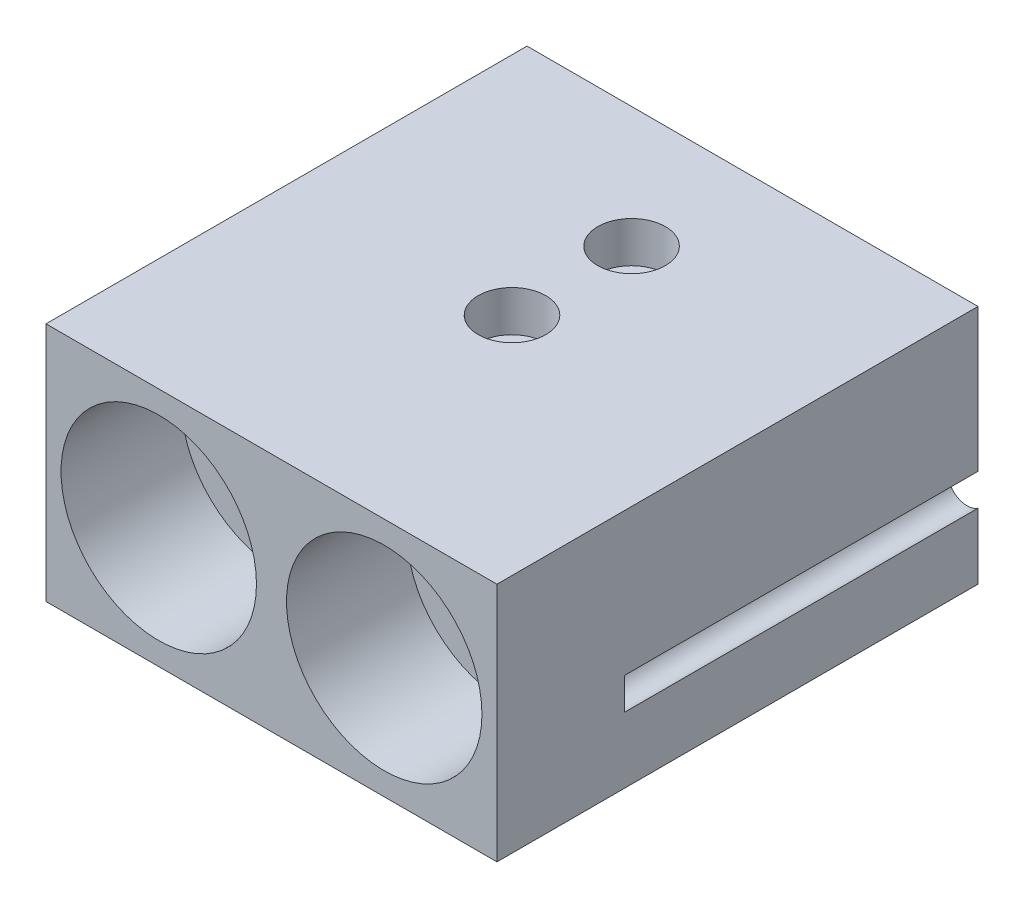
ISO-10303-21;
HEADER;
FILE_DESCRIPTION(('STEP AP214'),'2;1');
FILE_NAME('part.step','',(''),(''),'','','');
FILE_SCHEMA(('AUTOMOTIVE_DESIGN { 1 0 10303 214 1 1 1 1 }'));
ENDSEC;
DATA;
#1=APPLICATION_CONTEXT('core data for automotive mechanical design processes');
#2=APPLICATION_PROTOCOL_DEFINITION('international standard','automotive_design',2000,#1);
#3=PRODUCT_CONTEXT('',#1,'mechanical');
#4=PRODUCT('Part','Part','',(#3));
#5=PRODUCT_RELATED_PRODUCT_CATEGORY('part','',(#4));
#6=PRODUCT_DEFINITION_FORMATION('','',#4);
#7=PRODUCT_DEFINITION_CONTEXT('part definition',#1,'design');
#8=PRODUCT_DEFINITION('design','',#6,#7);
#9=PRODUCT_DEFINITION_SHAPE('','',#8);
#10=(LENGTH_UNIT() NAMED_UNIT(*) SI_UNIT(.MILLI.,.METRE.));
#11=(NAMED_UNIT(*) PLANE_ANGLE_UNIT() SI_UNIT($,.RADIAN.));
#12=(NAMED_UNIT(*) SI_UNIT($,.STERADIAN.) SOLID_ANGLE_UNIT());
#13=UNCERTAINTY_MEASURE_WITH_UNIT(LENGTH_MEASURE(1.E-05),#10,'distance_accuracy_value','');
#14=(GEOMETRIC_REPRESENTATION_CONTEXT(3) GLOBAL_UNCERTAINTY_ASSIGNED_CONTEXT((#13)) GLOBAL_UNIT_ASSIGNED_CONTEXT((#10,
#11,#12)) REPRESENTATION_CONTEXT('',''));
#15=CARTESIAN_POINT('',(0.,0.,0.));
#16=DIRECTION('',(0.,0.,1.));
#17=DIRECTION('',(1.,0.,0.));
#18=AXIS2_PLACEMENT_3D('',#15,#16,#17);
#19=CARTESIAN_POINT('',(0.,-12.7,-25.4));
#20=DIRECTION('',(0.,-1.,0.));
#21=DIRECTION('',(0.,0.,-1.));
#22=AXIS2_PLACEMENT_3D('',#19,#20,#21);
#23=CYLINDRICAL_SURFACE('',#22,2.01929999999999);
#24=CARTESIAN_POINT('',(0.,-12.7,-25.4));
#25=DIRECTION('',(0.,-1.,0.));
#26=DIRECTION('',(0.,0.,-1.));
#27=AXIS2_PLACEMENT_3D('',#24,#25,#26);
#28=CIRCLE('',#27,2.01929999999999);
#29=CARTESIAN_POINT('',(0.,-12.7,-27.4193));
#30=VERTEX_POINT('',#29);
#31=EDGE_CURVE('E182',#30,#30,#28,.T.);
#32=ORIENTED_EDGE('',*,*,#31,.T.);
#33=EDGE_LOOP('',(#32));
#34=FACE_BOUND('',#33,.T.);
#35=CARTESIAN_POINT('',(0.,8.382,-25.4));
#36=DIRECTION('',(0.,1.,0.));
#37=DIRECTION('',(0.,0.,1.));
#38=AXIS2_PLACEMENT_3D('',#35,#36,#37);
#39=CIRCLE('',#38,2.01929999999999);
#40=CARTESIAN_POINT('',(0.,8.382,-23.3807));
#41=VERTEX_POINT('',#40);
#42=EDGE_CURVE('E168',#41,#41,#39,.F.);
#43=ORIENTED_EDGE('',*,*,#42,.F.);
#44=EDGE_LOOP('',(#43));
#45=FACE_BOUND('',#44,.T.);
#46=ADVANCED_FACE('F38',(#34,#45),#23,.F.);
#47=CARTESIAN_POINT('',(0.,-12.7,-38.1));
#48=DIRECTION('',(0.,-1.,0.));
#49=DIRECTION('',(0.,0.,-1.));
#50=AXIS2_PLACEMENT_3D('',#47,#48,#49);
#51=CYLINDRICAL_SURFACE('',#50,2.01929999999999);
#52=CARTESIAN_POINT('',(0.,1.35255,-40.1193));
#53=CARTESIAN_POINT('',(0.0678940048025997,1.35255113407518,-40.119300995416));
#54=CARTESIAN_POINT('',(0.135782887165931,1.34741066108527,-40.1158469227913));
#55=CARTESIAN_POINT('',(0.269391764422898,1.32717332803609,-40.1023769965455));
#56=CARTESIAN_POINT('',(0.335110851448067,1.31207235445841,-40.0923584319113));
#57=CARTESIAN_POINT('',(0.46225337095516,1.27284086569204,-40.0667450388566));
#58=CARTESIAN_POINT('',(0.523695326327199,1.24875258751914,-40.0511763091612));
#59=CARTESIAN_POINT('',(0.641412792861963,1.19257678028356,-40.015710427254));
#60=CARTESIAN_POINT('',(0.697687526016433,1.16048804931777,-39.9958126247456));
#61=CARTESIAN_POINT('',(0.808887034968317,1.08624944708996,-39.9512591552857));
#62=CARTESIAN_POINT('',(0.863288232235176,1.04347527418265,-39.9263425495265));
#63=CARTESIAN_POINT('',(0.964638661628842,0.950578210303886,-39.8749035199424));
#64=CARTESIAN_POINT('',(1.01157694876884,0.900444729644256,-39.8483788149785));
#65=CARTESIAN_POINT('',(1.10432596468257,0.784975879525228,-39.7915785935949));
#66=CARTESIAN_POINT('',(1.14876320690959,0.718491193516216,-39.7613794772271));
#67=CARTESIAN_POINT('',(1.22578701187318,0.577300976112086,-39.7053928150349));
#68=CARTESIAN_POINT('',(1.25839405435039,0.502609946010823,-39.6795976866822));
#69=CARTESIAN_POINT('',(1.30254653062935,0.369011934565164,-39.6432156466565));
#70=CARTESIAN_POINT('',(1.31745953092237,0.311834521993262,-39.6303875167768));
#71=CARTESIAN_POINT('',(1.33972784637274,0.195039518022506,-39.6109354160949));
#72=CARTESIAN_POINT('',(1.3470963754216,0.13542638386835,-39.6043005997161));
#73=CARTESIAN_POINT('',(1.35381158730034,0.0151134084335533,-39.5982626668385));
#74=CARTESIAN_POINT('',(1.35312441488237,-0.0455899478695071,-39.5988900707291));
#75=CARTESIAN_POINT('',(1.34369719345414,-0.165879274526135,-39.6073439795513));
#76=CARTESIAN_POINT('',(1.33495031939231,-0.225464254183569,-39.615176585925));
#77=CARTESIAN_POINT('',(1.31056537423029,-0.339176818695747,-39.6363046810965));
#78=CARTESIAN_POINT('',(1.29526269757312,-0.393429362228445,-39.6493323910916));
#79=CARTESIAN_POINT('',(1.25851666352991,-0.498633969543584,-39.6793256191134));
#80=CARTESIAN_POINT('',(1.23707128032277,-0.549584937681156,-39.6962924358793));
#81=CARTESIAN_POINT('',(1.18363624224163,-0.657836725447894,-39.7364312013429));
#82=CARTESIAN_POINT('',(1.15038728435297,-0.714306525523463,-39.7601626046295));
#83=CARTESIAN_POINT('',(1.07644690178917,-0.821524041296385,-39.8090360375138));
#84=CARTESIAN_POINT('',(1.03574627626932,-0.872264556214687,-39.8341797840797));
#85=CARTESIAN_POINT('',(0.937626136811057,-0.978024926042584,-39.8894851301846));
#86=CARTESIAN_POINT('',(0.878498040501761,-1.03153555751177,-39.9195354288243));
#87=CARTESIAN_POINT('',(0.75061777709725,-1.12798931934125,-39.9759038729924));
#88=CARTESIAN_POINT('',(0.681874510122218,-1.17094212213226,-40.0022254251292));
#89=CARTESIAN_POINT('',(0.550307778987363,-1.23728281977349,-40.0438424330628));
#90=CARTESIAN_POINT('',(0.488950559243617,-1.26285348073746,-40.0602873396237));
#91=CARTESIAN_POINT('',(0.362031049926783,-1.3049074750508,-40.087638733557));
#92=CARTESIAN_POINT('',(0.296472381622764,-1.32139851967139,-40.0985499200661));
#93=CARTESIAN_POINT('',(0.162564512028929,-1.34446929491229,-40.1138776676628));
#94=CARTESIAN_POINT('',(0.0942042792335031,-1.35100499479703,-40.1182653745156));
#95=CARTESIAN_POINT('',(-0.0428079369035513,-1.35360670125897,-40.120007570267));
#96=CARTESIAN_POINT('',(-0.111459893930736,-1.3496736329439,-40.1173626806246));
#97=CARTESIAN_POINT('',(-0.241855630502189,-1.33225805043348,-40.1057556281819));
#98=CARTESIAN_POINT('',(-0.30373978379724,-1.31948726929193,-40.0972645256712));
#99=CARTESIAN_POINT('',(-0.424275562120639,-1.28580727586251,-40.0751759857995));
#100=CARTESIAN_POINT('',(-0.482926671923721,-1.26489677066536,-40.0615777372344));
#101=CARTESIAN_POINT('',(-0.599199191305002,-1.21433355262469,-40.0293483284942));
#102=CARTESIAN_POINT('',(-0.656558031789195,-1.18423969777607,-40.0104685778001));
#103=CARTESIAN_POINT('',(-0.765594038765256,-1.11685775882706,-39.9694485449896));
#104=CARTESIAN_POINT('',(-0.817267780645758,-1.07956537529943,-39.9473063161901));
#105=CARTESIAN_POINT('',(-0.922129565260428,-0.992188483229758,-39.8975336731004));
#106=CARTESIAN_POINT('',(-0.974260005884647,-0.941013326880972,-39.8695895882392));
#107=CARTESIAN_POINT('',(-1.06967152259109,-0.830965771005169,-39.8136034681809));
#108=CARTESIAN_POINT('',(-1.11294602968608,-0.772087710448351,-39.7855613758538));
#109=CARTESIAN_POINT('',(-1.18692921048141,-0.652051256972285,-39.7342092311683));
#110=CARTESIAN_POINT('',(-1.21834935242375,-0.591418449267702,-39.7107010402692));
#111=CARTESIAN_POINT('',(-1.27208166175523,-0.464668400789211,-39.6686138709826));
#112=CARTESIAN_POINT('',(-1.29441017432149,-0.398561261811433,-39.6500260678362));
#113=CARTESIAN_POINT('',(-1.32559943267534,-0.274704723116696,-39.6233849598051));
#114=CARTESIAN_POINT('',(-1.33619048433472,-0.217680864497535,-39.614016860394));
#115=CARTESIAN_POINT('',(-1.34994404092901,-0.102080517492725,-39.6017701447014));
#116=CARTESIAN_POINT('',(-1.35311506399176,-0.0435058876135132,-39.5988840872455));
#117=CARTESIAN_POINT('',(-1.35181824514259,0.0735359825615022,-39.6000533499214));
#118=CARTESIAN_POINT('',(-1.34734378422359,0.132003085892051,-39.6041146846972));
#119=CARTESIAN_POINT('',(-1.33105541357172,0.247132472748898,-39.6185443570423));
#120=CARTESIAN_POINT('',(-1.31923168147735,0.30379223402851,-39.6289211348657));
#121=CARTESIAN_POINT('',(-1.28491576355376,0.428468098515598,-39.6579430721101));
#122=CARTESIAN_POINT('',(-1.26044618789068,0.495595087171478,-39.6780383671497));
#123=CARTESIAN_POINT('',(-1.20212019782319,0.623928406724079,-39.7229078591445));
#124=CARTESIAN_POINT('',(-1.16825053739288,0.685126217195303,-39.7476886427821));
#125=CARTESIAN_POINT('',(-1.09130908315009,0.802139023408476,-39.7996507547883));
#126=CARTESIAN_POINT('',(-1.04807745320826,0.857832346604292,-39.826868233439));
#127=CARTESIAN_POINT('',(-0.953388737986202,0.961975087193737,-39.8808978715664));
#128=CARTESIAN_POINT('',(-0.901929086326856,1.01042223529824,-39.9077099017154));
#129=CARTESIAN_POINT('',(-0.782848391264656,1.10599126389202,-39.9626987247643));
#130=CARTESIAN_POINT('',(-0.713959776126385,1.15179348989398,-39.9904639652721));
#131=CARTESIAN_POINT('',(-0.567178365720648,1.23069494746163,-40.0395458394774));
#132=CARTESIAN_POINT('',(-0.489298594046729,1.26381225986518,-40.060871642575));
#133=CARTESIAN_POINT('',(-0.343027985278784,1.31011088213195,-40.0910629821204));
#134=CARTESIAN_POINT('',(-0.275811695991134,1.3259412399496,-40.1015596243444));
#135=CARTESIAN_POINT('',(-0.13906043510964,1.34715568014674,-40.1156746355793));
#136=CARTESIAN_POINT('',(-0.069527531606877,1.35254883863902,-40.1192989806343));
#137=CARTESIAN_POINT('',(0.,1.35255,-40.1193));
#138=B_SPLINE_CURVE_WITH_KNOTS('',3,(#52,#53,#54,#55,#56,#57,#58,#59,#60,#61,#62,#63,#64,#65,
#66,#67,#68,#69,#70,#71,#72,#73,#74,#75,#76,#77,#78,#79,#80,#81,#82,#83,#84,#85,#86,#87,#88,#89,
#90,#91,#92,#93,#94,#95,#96,#97,#98,#99,#100,#101,#102,#103,#104,#105,#106,#107,#108,#109,#110,
#111,#112,#113,#114,#115,#116,#117,#118,#119,#120,#121,#122,#123,#124,#125,#126,#127,#128,#129,
#130,#131,#132,#133,#134,#135,#136,#137),.UNSPECIFIED.,.T.,.F.,(4,2,2,2,2,2,2,2,2,2,2,2,2,2,2,2,
2,2,2,2,2,2,2,2,2,2,2,2,2,2,2,2,2,2,2,2,2,2,2,2,2,2,4),(0.,0.203402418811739,0.406888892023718,
0.609430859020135,0.812003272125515,1.03183599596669,1.251988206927,1.50724812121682,
1.76206401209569,1.94274858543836,2.12311615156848,2.30424200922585,2.48552138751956,
2.65846448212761,2.83146467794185,3.03982886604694,3.24845208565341,3.5029126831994,
3.75713928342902,3.9617109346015,4.16610857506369,4.37140763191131,4.57668854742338,
4.76711246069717,4.95756663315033,5.15920123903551,5.36095664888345,5.59468293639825,
5.82858196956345,6.04445199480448,6.25993219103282,6.43542564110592,6.6107175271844,
6.78616124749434,6.9618399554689,7.18330709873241,7.40508791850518,7.6310048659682,
7.85699241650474,8.11731445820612,8.37726404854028,8.58574169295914,8.79403796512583),.UNSPECIFIED.);
#139=CARTESIAN_POINT('',(0.,1.35255,-40.1193));
#140=VERTEX_POINT('',#139);
#141=EDGE_CURVE('E164',#140,#140,#138,.T.);
#142=ORIENTED_EDGE('',*,*,#141,.T.);
#143=EDGE_LOOP('',(#142));
#144=FACE_BOUND('',#143,.T.);
#145=CARTESIAN_POINT('',(0.,-12.7,-38.1));
#146=DIRECTION('',(0.,-1.,0.));
#147=DIRECTION('',(0.,0.,-1.));
#148=AXIS2_PLACEMENT_3D('',#145,#146,#147);
#149=CIRCLE('',#148,2.01929999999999);
#150=CARTESIAN_POINT('',(0.,-12.7,-40.1193));
#151=VERTEX_POINT('',#150);
#152=EDGE_CURVE('E179',#151,#151,#149,.T.);
#153=ORIENTED_EDGE('',*,*,#152,.T.);
#154=EDGE_LOOP('',(#153));
#155=FACE_BOUND('',#154,.T.);
#156=CARTESIAN_POINT('',(0.,8.382,-38.1));
#157=DIRECTION('',(0.,1.,0.));
#158=DIRECTION('',(0.,0.,1.));
#159=AXIS2_PLACEMENT_3D('',#156,#157,#158);
#160=CIRCLE('',#159,2.01929999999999);
#161=CARTESIAN_POINT('',(0.,8.382,-36.0807));
#162=VERTEX_POINT('',#161);
#163=EDGE_CURVE('E175',#162,#162,#160,.F.);
#164=ORIENTED_EDGE('',*,*,#163,.F.);
#165=EDGE_LOOP('',(#164));
#166=FACE_BOUND('',#165,.T.);
#167=ADVANCED_FACE('F252',(#144,#155,#166),#51,.F.);
#168=CARTESIAN_POINT('',(-11.90625,0.,-50.8));
#169=DIRECTION('',(0.,0.,1.));
#170=DIRECTION('',(1.,0.,0.));
#171=AXIS2_PLACEMENT_3D('',#168,#169,#170);
#172=CYLINDRICAL_SURFACE('',#171,7.14375);
#173=CARTESIAN_POINT('',(-11.90625,0.,-50.8));
#174=DIRECTION('',(0.,0.,1.));
#175=DIRECTION('',(1.,0.,0.));
#176=AXIS2_PLACEMENT_3D('',#173,#174,#175);
#177=CIRCLE('',#176,7.14375);
#178=CARTESIAN_POINT('',(-4.7625,0.,-50.8));
#179=VERTEX_POINT('',#178);
#180=EDGE_CURVE('E199',#179,#179,#177,.T.);
#181=ORIENTED_EDGE('',*,*,#180,.F.);
#182=EDGE_LOOP('',(#181));
#183=FACE_BOUND('',#182,.T.);
#184=CARTESIAN_POINT('',(-11.90625,0.,-12.7));
#185=DIRECTION('',(0.,0.,1.));
#186=DIRECTION('',(1.,0.,0.));
#187=AXIS2_PLACEMENT_3D('',#184,#185,#186);
#188=CIRCLE('',#187,7.14375);
#189=CARTESIAN_POINT('',(-4.7625,0.,-12.7));
#190=VERTEX_POINT('',#189);
#191=EDGE_CURVE('E189',#190,#190,#188,.F.);
#192=ORIENTED_EDGE('',*,*,#191,.F.);
#193=EDGE_LOOP('',(#192));
#194=FACE_BOUND('',#193,.T.);
#195=ADVANCED_FACE('F288',(#183,#194),#172,.F.);
#196=CARTESIAN_POINT('',(11.90625,0.,-50.8));
#197=DIRECTION('',(0.,0.,1.));
#198=DIRECTION('',(1.,0.,0.));
#199=AXIS2_PLACEMENT_3D('',#196,#197,#198);
#200=CYLINDRICAL_SURFACE('',#199,7.14375);
#201=CARTESIAN_POINT('',(11.90625,0.,-50.8));
#202=DIRECTION('',(0.,0.,1.));
#203=DIRECTION('',(1.,0.,0.));
#204=AXIS2_PLACEMENT_3D('',#201,#202,#203);
#205=CIRCLE('',#204,7.14375);
#206=CARTESIAN_POINT('',(19.05,0.,-50.8));
#207=VERTEX_POINT('',#206);
#208=EDGE_CURVE('E202',#207,#207,#205,.T.);
#209=ORIENTED_EDGE('',*,*,#208,.F.);
#210=EDGE_LOOP('',(#209));
#211=FACE_BOUND('',#210,.T.);
#212=CARTESIAN_POINT('',(11.90625,0.,-12.7));
#213=DIRECTION('',(0.,0.,1.));
#214=DIRECTION('',(1.,0.,0.));
#215=AXIS2_PLACEMENT_3D('',#212,#213,#214);
#216=CIRCLE('',#215,7.14375);
#217=CARTESIAN_POINT('',(19.05,0.,-12.7));
#218=VERTEX_POINT('',#217);
#219=EDGE_CURVE('E195',#218,#218,#216,.F.);
#220=ORIENTED_EDGE('',*,*,#219,.F.);
#221=EDGE_LOOP('',(#220));
#222=FACE_BOUND('',#221,.T.);
#223=ADVANCED_FACE('F310',(#211,#222),#200,.F.);
#224=CARTESIAN_POINT('',(-23.8125,12.7,-50.8));
#225=DIRECTION('',(-1.,0.,0.));
#226=DIRECTION('',(0.,0.,1.));
#227=AXIS2_PLACEMENT_3D('',#224,#225,#226);
#228=PLANE('',#227);
#229=DIRECTION('',(0.,0.,-1.));
#230=VECTOR('',#229,1.);
#231=CARTESIAN_POINT('',(-23.8125,-2.37724109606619,-13.462));
#232=LINE('',#231,#230);
#233=CARTESIAN_POINT('',(-23.8125,-2.37724109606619,-13.462));
#234=VERTEX_POINT('',#233);
#235=CARTESIAN_POINT('',(-23.8125,-2.37724109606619,-50.8));
#236=VERTEX_POINT('',#235);
#237=EDGE_CURVE('E53',#234,#236,#232,.T.);
#238=ORIENTED_EDGE('',*,*,#237,.F.);
#239=DIRECTION('',(0.,-1.,0.));
#240=VECTOR('',#239,1.);
#241=CARTESIAN_POINT('',(-23.8125,12.7,-13.462));
#242=LINE('',#241,#240);
#243=CARTESIAN_POINT('',(-23.8125,-5.75075890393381,-13.462));
#244=VERTEX_POINT('',#243);
#245=EDGE_CURVE('E11',#234,#244,#242,.T.);
#246=ORIENTED_EDGE('',*,*,#245,.T.);
#247=DIRECTION('',(0.,0.,-1.));
#248=VECTOR('',#247,1.);
#249=CARTESIAN_POINT('',(-23.8125,-5.75075890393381,-13.462));
#250=LINE('',#249,#248);
#251=CARTESIAN_POINT('',(-23.8125,-5.75075890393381,-50.8));
#252=VERTEX_POINT('',#251);
#253=EDGE_CURVE('E121',#252,#244,#250,.F.);
#254=ORIENTED_EDGE('',*,*,#253,.F.);
#255=DIRECTION('',(0.,-1.,0.));
#256=VECTOR('',#255,1.);
#257=CARTESIAN_POINT('',(-23.8125,12.7,-50.8));
#258=LINE('',#257,#256);
#259=CARTESIAN_POINT('',(-23.8125,-12.7,-50.8));
#260=VERTEX_POINT('',#259);
#261=EDGE_CURVE('E208',#252,#260,#258,.T.);
#262=ORIENTED_EDGE('',*,*,#261,.T.);
#263=DIRECTION('',(0.,0.,1.));
#264=VECTOR('',#263,1.);
#265=CARTESIAN_POINT('',(-23.8125,-12.7,-50.8));
#266=LINE('',#265,#264);
#267=CARTESIAN_POINT('',(-23.8125,-12.7,0.));
#268=VERTEX_POINT('',#267);
#269=EDGE_CURVE('E218',#260,#268,#266,.T.);
#270=ORIENTED_EDGE('',*,*,#269,.T.);
#271=DIRECTION('',(0.,-1.,0.));
#272=VECTOR('',#271,1.);
#273=CARTESIAN_POINT('',(-23.8125,12.7,0.));
#274=LINE('',#273,#272);
#275=CARTESIAN_POINT('',(-23.8125,12.7,0.));
#276=VERTEX_POINT('',#275);
#277=EDGE_CURVE('E205',#276,#268,#274,.T.);
#278=ORIENTED_EDGE('',*,*,#277,.F.);
#279=DIRECTION('',(0.,0.,1.));
#280=VECTOR('',#279,1.);
#281=CARTESIAN_POINT('',(-23.8125,12.7,-50.8));
#282=LINE('',#281,#280);
#283=CARTESIAN_POINT('',(-23.8125,12.7,-50.8));
#284=VERTEX_POINT('',#283);
#285=EDGE_CURVE('E230',#284,#276,#282,.T.);
#286=ORIENTED_EDGE('',*,*,#285,.F.);
#287=EDGE_CURVE('E126',#284,#236,#258,.T.);
#288=ORIENTED_EDGE('',*,*,#287,.T.);
#289=EDGE_LOOP('',(#238,#246,#254,#262,#270,#278,#286,#288));
#290=FACE_BOUND('',#289,.T.);
#291=ADVANCED_FACE('F40',(#290),#228,.T.);
#292=CARTESIAN_POINT('',(-23.8125,12.7,-50.8));
#293=DIRECTION('',(0.,1.,0.));
#294=DIRECTION('',(0.,0.,1.));
#295=AXIS2_PLACEMENT_3D('',#292,#293,#294);
#296=PLANE('',#295);
#297=CARTESIAN_POINT('',(0.,12.7,-25.4));
#298=DIRECTION('',(0.,1.,0.));
#299=DIRECTION('',(0.,0.,1.));
#300=AXIS2_PLACEMENT_3D('',#297,#298,#299);
#301=CIRCLE('',#300,3.571875);
#302=CARTESIAN_POINT('',(0.,12.7,-21.828125));
#303=VERTEX_POINT('',#302);
#304=EDGE_CURVE('E169',#303,#303,#301,.T.);
#305=ORIENTED_EDGE('',*,*,#304,.F.);
#306=EDGE_LOOP('',(#305));
#307=FACE_BOUND('',#306,.T.);
#308=CARTESIAN_POINT('',(0.,12.7,-38.0262378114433));
#309=DIRECTION('',(0.,1.,0.));
#310=DIRECTION('',(0.,0.,1.));
#311=AXIS2_PLACEMENT_3D('',#308,#309,#310);
#312=CIRCLE('',#311,3.571875);
#313=CARTESIAN_POINT('',(0.,12.7,-34.4543628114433));
#314=VERTEX_POINT('',#313);
#315=EDGE_CURVE('E176',#314,#314,#312,.T.);
#316=ORIENTED_EDGE('',*,*,#315,.F.);
#317=EDGE_LOOP('',(#316));
#318=FACE_BOUND('',#317,.T.);
#319=DIRECTION('',(-1.,0.,0.));
#320=VECTOR('',#319,1.);
#321=CARTESIAN_POINT('',(-23.8125,12.7,0.));
#322=LINE('',#321,#320);
#323=CARTESIAN_POINT('',(23.8125,12.7,0.));
#324=VERTEX_POINT('',#323);
#325=EDGE_CURVE('E227',#324,#276,#322,.T.);
#326=ORIENTED_EDGE('',*,*,#325,.F.);
#327=DIRECTION('',(0.,0.,1.));
#328=VECTOR('',#327,1.);
#329=CARTESIAN_POINT('',(23.8125,12.7,-50.8));
#330=LINE('',#329,#328);
#331=CARTESIAN_POINT('',(23.8125,12.7,-50.8));
#332=VERTEX_POINT('',#331);
#333=EDGE_CURVE('E233',#332,#324,#330,.T.);
#334=ORIENTED_EDGE('',*,*,#333,.F.);
#335=DIRECTION('',(-1.,0.,0.));
#336=VECTOR('',#335,1.);
#337=CARTESIAN_POINT('',(-23.8125,12.7,-50.8));
#338=LINE('',#337,#336);
#339=EDGE_CURVE('E215',#332,#284,#338,.T.);
#340=ORIENTED_EDGE('',*,*,#339,.T.);
#341=ORIENTED_EDGE('',*,*,#285,.T.);
#342=EDGE_LOOP('',(#326,#334,#340,#341));
#343=FACE_BOUND('',#342,.T.);
#344=ADVANCED_FACE('F323',(#307,#318,#343),#296,.T.);
#345=CARTESIAN_POINT('',(23.8125,12.7,-50.8));
#346=DIRECTION('',(1.,0.,0.));
#347=DIRECTION('',(0.,0.,-1.));
#348=AXIS2_PLACEMENT_3D('',#345,#346,#347);
#349=PLANE('',#348);
#350=DIRECTION('',(0.,0.,-1.));
#351=VECTOR('',#350,1.);
#352=CARTESIAN_POINT('',(23.8125,-5.75075890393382,-13.462));
#353=LINE('',#352,#351);
#354=CARTESIAN_POINT('',(23.8125,-5.75075890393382,-13.462));
#355=VERTEX_POINT('',#354);
#356=CARTESIAN_POINT('',(23.8125,-5.75075890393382,-50.8));
#357=VERTEX_POINT('',#356);
#358=EDGE_CURVE('E61',#355,#357,#353,.T.);
#359=ORIENTED_EDGE('',*,*,#358,.F.);
#360=DIRECTION('',(0.,1.,0.));
#361=VECTOR('',#360,1.);
#362=CARTESIAN_POINT('',(23.8125,12.7,-13.462));
#363=LINE('',#362,#361);
#364=CARTESIAN_POINT('',(23.8125,-2.37724109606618,-13.462));
#365=VERTEX_POINT('',#364);
#366=EDGE_CURVE('E46',#355,#365,#363,.T.);
#367=ORIENTED_EDGE('',*,*,#366,.T.);
#368=DIRECTION('',(0.,0.,-1.));
#369=VECTOR('',#368,1.);
#370=CARTESIAN_POINT('',(23.8125,-2.37724109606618,-13.462));
#371=LINE('',#370,#369);
#372=CARTESIAN_POINT('',(23.8125,-2.37724109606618,-50.8));
#373=VERTEX_POINT('',#372);
#374=EDGE_CURVE('E130',#373,#365,#371,.F.);
#375=ORIENTED_EDGE('',*,*,#374,.F.);
#376=DIRECTION('',(0.,1.,0.));
#377=VECTOR('',#376,1.);
#378=CARTESIAN_POINT('',(23.8125,12.7,-50.8));
#379=LINE('',#378,#377);
#380=EDGE_CURVE('E211',#373,#332,#379,.T.);
#381=ORIENTED_EDGE('',*,*,#380,.T.);
#382=ORIENTED_EDGE('',*,*,#333,.T.);
#383=DIRECTION('',(0.,1.,0.));
#384=VECTOR('',#383,1.);
#385=CARTESIAN_POINT('',(23.8125,12.7,0.));
#386=LINE('',#385,#384);
#387=CARTESIAN_POINT('',(23.8125,-12.7,0.));
#388=VERTEX_POINT('',#387);
#389=EDGE_CURVE('E224',#388,#324,#386,.T.);
#390=ORIENTED_EDGE('',*,*,#389,.F.);
#391=DIRECTION('',(0.,0.,1.));
#392=VECTOR('',#391,1.);
#393=CARTESIAN_POINT('',(23.8125,-12.7,-50.8));
#394=LINE('',#393,#392);
#395=CARTESIAN_POINT('',(23.8125,-12.7,-50.8));
#396=VERTEX_POINT('',#395);
#397=EDGE_CURVE('E235',#396,#388,#394,.T.);
#398=ORIENTED_EDGE('',*,*,#397,.F.);
#399=EDGE_CURVE('E212',#396,#357,#379,.T.);
#400=ORIENTED_EDGE('',*,*,#399,.T.);
#401=EDGE_LOOP('',(#359,#367,#375,#381,#382,#390,#398,#400));
#402=FACE_BOUND('',#401,.T.);
#403=ADVANCED_FACE('F326',(#402),#349,.T.);
#404=CARTESIAN_POINT('',(-23.8125,-12.7,-50.8));
#405=DIRECTION('',(0.,-1.,0.));
#406=DIRECTION('',(0.,0.,-1.));
#407=AXIS2_PLACEMENT_3D('',#404,#405,#406);
#408=PLANE('',#407);
#409=CARTESIAN_POINT('',(-21.4376,-12.7,-31.75));
#410=DIRECTION('',(0.,-1.,0.));
#411=DIRECTION('',(0.,0.,-1.));
#412=AXIS2_PLACEMENT_3D('',#409,#410,#411);
#413=CIRCLE('',#412,1.6129);
#414=CARTESIAN_POINT('',(-21.4376,-12.7,-33.3629));
#415=VERTEX_POINT('',#414);
#416=EDGE_CURVE('E337',#415,#415,#413,.T.);
#417=ORIENTED_EDGE('',*,*,#416,.F.);
#418=EDGE_LOOP('',(#417));
#419=FACE_BOUND('',#418,.T.);
#420=CARTESIAN_POINT('',(21.4376,-12.7,-31.75));
#421=DIRECTION('',(0.,-1.,0.));
#422=DIRECTION('',(0.,0.,-1.));
#423=AXIS2_PLACEMENT_3D('',#420,#421,#422);
#424=CIRCLE('',#423,1.6129);
#425=CARTESIAN_POINT('',(21.4376,-12.7,-33.3629));
#426=VERTEX_POINT('',#425);
#427=EDGE_CURVE('E341',#426,#426,#424,.T.);
#428=ORIENTED_EDGE('',*,*,#427,.F.);
#429=EDGE_LOOP('',(#428));
#430=FACE_BOUND('',#429,.T.);
#431=ORIENTED_EDGE('',*,*,#152,.F.);
#432=EDGE_LOOP('',(#431));
#433=FACE_BOUND('',#432,.T.);
#434=ORIENTED_EDGE('',*,*,#31,.F.);
#435=EDGE_LOOP('',(#434));
#436=FACE_BOUND('',#435,.T.);
#437=DIRECTION('',(1.,0.,0.));
#438=VECTOR('',#437,1.);
#439=CARTESIAN_POINT('',(-23.8125,-12.7,0.));
#440=LINE('',#439,#438);
#441=EDGE_CURVE('E221',#268,#388,#440,.T.);
#442=ORIENTED_EDGE('',*,*,#441,.F.);
#443=ORIENTED_EDGE('',*,*,#269,.F.);
#444=DIRECTION('',(1.,0.,0.));
#445=VECTOR('',#444,1.);
#446=CARTESIAN_POINT('',(-23.8125,-12.7,-50.8));
#447=LINE('',#446,#445);
#448=EDGE_CURVE('E207',#260,#396,#447,.T.);
#449=ORIENTED_EDGE('',*,*,#448,.T.);
#450=ORIENTED_EDGE('',*,*,#397,.T.);
#451=EDGE_LOOP('',(#442,#443,#449,#450));
#452=FACE_BOUND('',#451,.T.);
#453=ADVANCED_FACE('F318',(#419,#430,#433,#436,#452),#408,.T.);
#454=CARTESIAN_POINT('',(-23.8125,-12.7,-50.8));
#455=DIRECTION('',(0.,0.,1.));
#456=DIRECTION('',(1.,0.,0.));
#457=AXIS2_PLACEMENT_3D('',#454,#455,#456);
#458=PLANE('',#457);
#459=CARTESIAN_POINT('',(19.8374,8.7122,-50.8));
#460=DIRECTION('',(0.,0.,-1.));
#461=DIRECTION('',(-1.,0.,0.));
#462=AXIS2_PLACEMENT_3D('',#459,#460,#461);
#463=CIRCLE('',#462,1.35255);
#464=CARTESIAN_POINT('',(18.48485,8.7122,-50.8));
#465=VERTEX_POINT('',#464);
#466=EDGE_CURVE('E140',#465,#465,#463,.T.);
#467=ORIENTED_EDGE('',*,*,#466,.F.);
#468=EDGE_LOOP('',(#467));
#469=FACE_BOUND('',#468,.T.);
#470=CARTESIAN_POINT('',(-19.8374,8.7122,-50.8));
#471=DIRECTION('',(0.,0.,-1.));
#472=DIRECTION('',(-1.,0.,0.));
#473=AXIS2_PLACEMENT_3D('',#470,#471,#472);
#474=CIRCLE('',#473,1.35255);
#475=CARTESIAN_POINT('',(-21.18995,8.7122,-50.8));
#476=VERTEX_POINT('',#475);
#477=EDGE_CURVE('E146',#476,#476,#474,.T.);
#478=ORIENTED_EDGE('',*,*,#477,.F.);
#479=EDGE_LOOP('',(#478));
#480=FACE_BOUND('',#479,.T.);
#481=CARTESIAN_POINT('',(-19.8374,-8.7376,-50.8));
#482=DIRECTION('',(0.,0.,-1.));
#483=DIRECTION('',(-1.,0.,0.));
#484=AXIS2_PLACEMENT_3D('',#481,#482,#483);
#485=CIRCLE('',#484,1.35255);
#486=CARTESIAN_POINT('',(-21.18995,-8.7376,-50.8));
#487=VERTEX_POINT('',#486);
#488=EDGE_CURVE('E152',#487,#487,#485,.T.);
#489=ORIENTED_EDGE('',*,*,#488,.F.);
#490=EDGE_LOOP('',(#489));
#491=FACE_BOUND('',#490,.T.);
#492=CARTESIAN_POINT('',(19.8374,-8.7376,-50.8));
#493=DIRECTION('',(0.,0.,-1.));
#494=DIRECTION('',(-1.,0.,0.));
#495=AXIS2_PLACEMENT_3D('',#492,#493,#494);
#496=CIRCLE('',#495,1.35255);
#497=CARTESIAN_POINT('',(18.48485,-8.7376,-50.8));
#498=VERTEX_POINT('',#497);
#499=EDGE_CURVE('E158',#498,#498,#496,.T.);
#500=ORIENTED_EDGE('',*,*,#499,.F.);
#501=EDGE_LOOP('',(#500));
#502=FACE_BOUND('',#501,.T.);
#503=CARTESIAN_POINT('',(0.,0.,-50.8));
#504=DIRECTION('',(0.,0.,-1.));
#505=DIRECTION('',(-1.,0.,0.));
#506=AXIS2_PLACEMENT_3D('',#503,#504,#505);
#507=CIRCLE('',#506,1.35255);
#508=CARTESIAN_POINT('',(-1.35255,0.,-50.8));
#509=VERTEX_POINT('',#508);
#510=EDGE_CURVE('E161',#509,#509,#507,.T.);
#511=ORIENTED_EDGE('',*,*,#510,.F.);
#512=EDGE_LOOP('',(#511));
#513=FACE_BOUND('',#512,.T.);
#514=ORIENTED_EDGE('',*,*,#180,.T.);
#515=EDGE_LOOP('',(#514));
#516=FACE_BOUND('',#515,.T.);
#517=ORIENTED_EDGE('',*,*,#208,.T.);
#518=EDGE_LOOP('',(#517));
#519=FACE_BOUND('',#518,.T.);
#520=ORIENTED_EDGE('',*,*,#261,.F.);
#521=CARTESIAN_POINT('',(-22.6568,-4.064,-50.8));
#522=DIRECTION('',(0.,0.,-1.));
#523=DIRECTION('',(-1.,0.,0.));
#524=AXIS2_PLACEMENT_3D('',#521,#522,#523);
#525=CIRCLE('',#524,2.0447);
#526=EDGE_CURVE('E122',#236,#252,#525,.T.);
#527=ORIENTED_EDGE('',*,*,#526,.F.);
#528=ORIENTED_EDGE('',*,*,#287,.F.);
#529=ORIENTED_EDGE('',*,*,#339,.F.);
#530=ORIENTED_EDGE('',*,*,#380,.F.);
#531=CARTESIAN_POINT('',(22.6568,-4.064,-50.8));
#532=DIRECTION('',(0.,0.,1.));
#533=DIRECTION('',(1.,0.,0.));
#534=AXIS2_PLACEMENT_3D('',#531,#532,#533);
#535=CIRCLE('',#534,2.0447);
#536=EDGE_CURVE('E232',#373,#357,#535,.T.);
#537=ORIENTED_EDGE('',*,*,#536,.T.);
#538=ORIENTED_EDGE('',*,*,#399,.F.);
#539=ORIENTED_EDGE('',*,*,#448,.F.);
#540=EDGE_LOOP('',(#520,#527,#528,#529,#530,#537,#538,#539));
#541=FACE_BOUND('',#540,.T.);
#542=ADVANCED_FACE('F315',(#469,#480,#491,#502,#513,#516,#519,#541),#458,.F.);
#543=CARTESIAN_POINT('',(-23.8125,-12.7,0.));
#544=DIRECTION('',(0.,0.,1.));
#545=DIRECTION('',(1.,0.,0.));
#546=AXIS2_PLACEMENT_3D('',#543,#544,#545);
#547=PLANE('',#546);
#548=CARTESIAN_POINT('',(-11.90625,0.,0.));
#549=DIRECTION('',(0.,0.,1.));
#550=DIRECTION('',(1.,0.,0.));
#551=AXIS2_PLACEMENT_3D('',#548,#549,#550);
#552=CIRCLE('',#551,10.31875);
#553=CARTESIAN_POINT('',(-1.5875,0.,0.));
#554=VERTEX_POINT('',#553);
#555=EDGE_CURVE('E185',#554,#554,#552,.T.);
#556=ORIENTED_EDGE('',*,*,#555,.F.);
#557=EDGE_LOOP('',(#556));
#558=FACE_BOUND('',#557,.T.);
#559=CARTESIAN_POINT('',(11.90625,0.,0.));
#560=DIRECTION('',(0.,0.,1.));
#561=DIRECTION('',(1.,0.,0.));
#562=AXIS2_PLACEMENT_3D('',#559,#560,#561);
#563=CIRCLE('',#562,10.31875);
#564=CARTESIAN_POINT('',(22.225,0.,0.));
#565=VERTEX_POINT('',#564);
#566=EDGE_CURVE('E196',#565,#565,#563,.T.);
#567=ORIENTED_EDGE('',*,*,#566,.F.);
#568=EDGE_LOOP('',(#567));
#569=FACE_BOUND('',#568,.T.);
#570=ORIENTED_EDGE('',*,*,#277,.T.);
#571=ORIENTED_EDGE('',*,*,#441,.T.);
#572=ORIENTED_EDGE('',*,*,#389,.T.);
#573=ORIENTED_EDGE('',*,*,#325,.T.);
#574=EDGE_LOOP('',(#570,#571,#572,#573));
#575=FACE_BOUND('',#574,.T.);
#576=ADVANCED_FACE('F303',(#558,#569,#575),#547,.T.);
#577=CARTESIAN_POINT('',(11.90625,0.,-12.7));
#578=DIRECTION('',(0.,0.,1.));
#579=DIRECTION('',(1.,0.,0.));
#580=AXIS2_PLACEMENT_3D('',#577,#578,#579);
#581=PLANE('',#580);
#582=CARTESIAN_POINT('',(11.90625,0.,-12.7));
#583=DIRECTION('',(0.,0.,1.));
#584=DIRECTION('',(1.,0.,0.));
#585=AXIS2_PLACEMENT_3D('',#582,#583,#584);
#586=CIRCLE('',#585,10.31875);
#587=CARTESIAN_POINT('',(22.225,0.,-12.7));
#588=VERTEX_POINT('',#587);
#589=EDGE_CURVE('E192',#588,#588,#586,.T.);
#590=ORIENTED_EDGE('',*,*,#589,.T.);
#591=EDGE_LOOP('',(#590));
#592=FACE_BOUND('',#591,.T.);
#593=ORIENTED_EDGE('',*,*,#219,.T.);
#594=EDGE_LOOP('',(#593));
#595=FACE_BOUND('',#594,.T.);
#596=ADVANCED_FACE('F300',(#592,#595),#581,.T.);
#597=CARTESIAN_POINT('',(11.90625,0.,-12.7));
#598=DIRECTION('',(0.,0.,1.));
#599=DIRECTION('',(1.,0.,0.));
#600=AXIS2_PLACEMENT_3D('',#597,#598,#599);
#601=CYLINDRICAL_SURFACE('',#600,10.31875);
#602=ORIENTED_EDGE('',*,*,#589,.F.);
#603=EDGE_LOOP('',(#602));
#604=FACE_BOUND('',#603,.T.);
#605=ORIENTED_EDGE('',*,*,#566,.T.);
#606=EDGE_LOOP('',(#605));
#607=FACE_BOUND('',#606,.T.);
#608=ADVANCED_FACE('F295',(#604,#607),#601,.F.);
#609=CARTESIAN_POINT('',(-11.90625,0.,-12.7));
#610=DIRECTION('',(0.,0.,1.));
#611=DIRECTION('',(1.,0.,0.));
#612=AXIS2_PLACEMENT_3D('',#609,#610,#611);
#613=PLANE('',#612);
#614=CARTESIAN_POINT('',(-11.90625,0.,-12.7));
#615=DIRECTION('',(0.,0.,1.));
#616=DIRECTION('',(1.,0.,0.));
#617=AXIS2_PLACEMENT_3D('',#614,#615,#616);
#618=CIRCLE('',#617,10.31875);
#619=CARTESIAN_POINT('',(-1.5875,0.,-12.7));
#620=VERTEX_POINT('',#619);
#621=EDGE_CURVE('E186',#620,#620,#618,.T.);
#622=ORIENTED_EDGE('',*,*,#621,.T.);
#623=EDGE_LOOP('',(#622));
#624=FACE_BOUND('',#623,.T.);
#625=ORIENTED_EDGE('',*,*,#191,.T.);
#626=EDGE_LOOP('',(#625));
#627=FACE_BOUND('',#626,.T.);
#628=ADVANCED_FACE('F292',(#624,#627),#613,.T.);
#629=CARTESIAN_POINT('',(-11.90625,0.,-12.7));
#630=DIRECTION('',(0.,0.,1.));
#631=DIRECTION('',(1.,0.,0.));
#632=AXIS2_PLACEMENT_3D('',#629,#630,#631);
#633=CYLINDRICAL_SURFACE('',#632,10.31875);
#634=ORIENTED_EDGE('',*,*,#621,.F.);
#635=EDGE_LOOP('',(#634));
#636=FACE_BOUND('',#635,.T.);
#637=ORIENTED_EDGE('',*,*,#555,.T.);
#638=EDGE_LOOP('',(#637));
#639=FACE_BOUND('',#638,.T.);
#640=ADVANCED_FACE('F275',(#636,#639),#633,.F.);
#641=CARTESIAN_POINT('',(0.,8.382,-38.0262378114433));
#642=DIRECTION('',(0.,1.,0.));
#643=DIRECTION('',(0.,0.,1.));
#644=AXIS2_PLACEMENT_3D('',#641,#642,#643);
#645=PLANE('',#644);
#646=CARTESIAN_POINT('',(0.,8.382,-38.0262378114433));
#647=DIRECTION('',(0.,1.,0.));
#648=DIRECTION('',(0.,0.,1.));
#649=AXIS2_PLACEMENT_3D('',#646,#647,#648);
#650=CIRCLE('',#649,3.571875);
#651=CARTESIAN_POINT('',(0.,8.382,-34.4543628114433));
#652=VERTEX_POINT('',#651);
#653=EDGE_CURVE('E172',#652,#652,#650,.T.);
#654=ORIENTED_EDGE('',*,*,#653,.T.);
#655=EDGE_LOOP('',(#654));
#656=FACE_BOUND('',#655,.T.);
#657=ORIENTED_EDGE('',*,*,#163,.T.);
#658=EDGE_LOOP('',(#657));
#659=FACE_BOUND('',#658,.T.);
#660=ADVANCED_FACE('F273',(#656,#659),#645,.T.);
#661=CARTESIAN_POINT('',(0.,8.382,-38.0262378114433));
#662=DIRECTION('',(0.,1.,0.));
#663=DIRECTION('',(0.,0.,1.));
#664=AXIS2_PLACEMENT_3D('',#661,#662,#663);
#665=CYLINDRICAL_SURFACE('',#664,3.571875);
#666=ORIENTED_EDGE('',*,*,#653,.F.);
#667=EDGE_LOOP('',(#666));
#668=FACE_BOUND('',#667,.T.);
#669=ORIENTED_EDGE('',*,*,#315,.T.);
#670=EDGE_LOOP('',(#669));
#671=FACE_BOUND('',#670,.T.);
#672=ADVANCED_FACE('F268',(#668,#671),#665,.F.);
#673=CARTESIAN_POINT('',(0.,8.382,-25.4));
#674=DIRECTION('',(0.,1.,0.));
#675=DIRECTION('',(0.,0.,1.));
#676=AXIS2_PLACEMENT_3D('',#673,#674,#675);
#677=PLANE('',#676);
#678=CARTESIAN_POINT('',(0.,8.382,-25.4));
#679=DIRECTION('',(0.,1.,0.));
#680=DIRECTION('',(0.,0.,1.));
#681=AXIS2_PLACEMENT_3D('',#678,#679,#680);
#682=CIRCLE('',#681,3.571875);
#683=CARTESIAN_POINT('',(0.,8.382,-21.828125));
#684=VERTEX_POINT('',#683);
#685=EDGE_CURVE('E165',#684,#684,#682,.T.);
#686=ORIENTED_EDGE('',*,*,#685,.T.);
#687=EDGE_LOOP('',(#686));
#688=FACE_BOUND('',#687,.T.);
#689=ORIENTED_EDGE('',*,*,#42,.T.);
#690=EDGE_LOOP('',(#689));
#691=FACE_BOUND('',#690,.T.);
#692=ADVANCED_FACE('F265',(#688,#691),#677,.T.);
#693=CARTESIAN_POINT('',(0.,8.382,-25.4));
#694=DIRECTION('',(0.,1.,0.));
#695=DIRECTION('',(0.,0.,1.));
#696=AXIS2_PLACEMENT_3D('',#693,#694,#695);
#697=CYLINDRICAL_SURFACE('',#696,3.571875);
#698=ORIENTED_EDGE('',*,*,#685,.F.);
#699=EDGE_LOOP('',(#698));
#700=FACE_BOUND('',#699,.T.);
#701=ORIENTED_EDGE('',*,*,#304,.T.);
#702=EDGE_LOOP('',(#701));
#703=FACE_BOUND('',#702,.T.);
#704=ADVANCED_FACE('F262',(#700,#703),#697,.F.);
#705=CARTESIAN_POINT('',(0.,0.,-50.8));
#706=DIRECTION('',(0.,0.,-1.));
#707=DIRECTION('',(-1.,0.,0.));
#708=AXIS2_PLACEMENT_3D('',#705,#706,#707);
#709=CYLINDRICAL_SURFACE('',#708,1.35255);
#710=ORIENTED_EDGE('',*,*,#510,.T.);
#711=EDGE_LOOP('',(#710));
#712=FACE_BOUND('',#711,.T.);
#713=ORIENTED_EDGE('',*,*,#141,.F.);
#714=EDGE_LOOP('',(#713));
#715=FACE_BOUND('',#714,.T.);
#716=ADVANCED_FACE('F256',(#712,#715),#709,.F.);
#717=CARTESIAN_POINT('',(19.8374,-8.7376,-50.8));
#718=DIRECTION('',(0.,0.,-1.));
#719=DIRECTION('',(-1.,0.,0.));
#720=AXIS2_PLACEMENT_3D('',#717,#718,#719);
#721=CYLINDRICAL_SURFACE('',#720,1.35255);
#722=CARTESIAN_POINT('',(19.8374,-8.7376,-37.2872));
#723=DIRECTION('',(0.,0.,-1.));
#724=DIRECTION('',(-1.,0.,0.));
#725=AXIS2_PLACEMENT_3D('',#722,#723,#724);
#726=CIRCLE('',#725,1.35255);
#727=CARTESIAN_POINT('',(18.48485,-8.7376,-37.2872));
#728=VERTEX_POINT('',#727);
#729=EDGE_CURVE('E155',#728,#728,#726,.T.);
#730=ORIENTED_EDGE('',*,*,#729,.F.);
#731=EDGE_LOOP('',(#730));
#732=FACE_BOUND('',#731,.T.);
#733=ORIENTED_EDGE('',*,*,#499,.T.);
#734=EDGE_LOOP('',(#733));
#735=FACE_BOUND('',#734,.T.);
#736=ADVANCED_FACE('F261',(#732,#735),#721,.F.);
#737=CARTESIAN_POINT('',(19.8374,-8.7376,-37.2872));
#738=DIRECTION('',(0.,0.,-1.));
#739=DIRECTION('',(-1.,0.,0.));
#740=AXIS2_PLACEMENT_3D('',#737,#738,#739);
#741=CONICAL_SURFACE('',#740,1.35255,1.02974425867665);
#742=CARTESIAN_POINT('',(19.8374,-8.7376,-36.4745059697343));
#743=VERTEX_POINT('',#742);
#744=VERTEX_LOOP('',#743);
#745=FACE_BOUND('',#744,.T.);
#746=ORIENTED_EDGE('',*,*,#729,.T.);
#747=EDGE_LOOP('',(#746));
#748=FACE_BOUND('',#747,.T.);
#749=ADVANCED_FACE('F397',(#745,#748),#741,.F.);
#750=CARTESIAN_POINT('',(-19.8374,-8.7376,-50.8));
#751=DIRECTION('',(0.,0.,-1.));
#752=DIRECTION('',(-1.,0.,0.));
#753=AXIS2_PLACEMENT_3D('',#750,#751,#752);
#754=CYLINDRICAL_SURFACE('',#753,1.35255);
#755=CARTESIAN_POINT('',(-19.8374,-8.7376,-37.2872));
#756=DIRECTION('',(0.,0.,-1.));
#757=DIRECTION('',(-1.,0.,0.));
#758=AXIS2_PLACEMENT_3D('',#755,#756,#757);
#759=CIRCLE('',#758,1.35255);
#760=CARTESIAN_POINT('',(-21.18995,-8.7376,-37.2872));
#761=VERTEX_POINT('',#760);
#762=EDGE_CURVE('E149',#761,#761,#759,.T.);
#763=ORIENTED_EDGE('',*,*,#762,.F.);
#764=EDGE_LOOP('',(#763));
#765=FACE_BOUND('',#764,.T.);
#766=ORIENTED_EDGE('',*,*,#488,.T.);
#767=EDGE_LOOP('',(#766));
#768=FACE_BOUND('',#767,.T.);
#769=ADVANCED_FACE('F394',(#765,#768),#754,.F.);
#770=CARTESIAN_POINT('',(-19.8374,-8.7376,-37.2872));
#771=DIRECTION('',(0.,0.,-1.));
#772=DIRECTION('',(-1.,0.,0.));
#773=AXIS2_PLACEMENT_3D('',#770,#771,#772);
#774=CONICAL_SURFACE('',#773,1.35255,1.02974425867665);
#775=CARTESIAN_POINT('',(-19.8374,-8.7376,-36.4745059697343));
#776=VERTEX_POINT('',#775);
#777=VERTEX_LOOP('',#776);
#778=FACE_BOUND('',#777,.T.);
#779=ORIENTED_EDGE('',*,*,#762,.T.);
#780=EDGE_LOOP('',(#779));
#781=FACE_BOUND('',#780,.T.);
#782=ADVANCED_FACE('F390',(#778,#781),#774,.F.);
#783=CARTESIAN_POINT('',(-19.8374,8.7122,-50.8));
#784=DIRECTION('',(0.,0.,-1.));
#785=DIRECTION('',(-1.,0.,0.));
#786=AXIS2_PLACEMENT_3D('',#783,#784,#785);
#787=CYLINDRICAL_SURFACE('',#786,1.35255);
#788=CARTESIAN_POINT('',(-19.8374,8.7122,-37.2872));
#789=DIRECTION('',(0.,0.,-1.));
#790=DIRECTION('',(-1.,0.,0.));
#791=AXIS2_PLACEMENT_3D('',#788,#789,#790);
#792=CIRCLE('',#791,1.35255);
#793=CARTESIAN_POINT('',(-21.18995,8.7122,-37.2872));
#794=VERTEX_POINT('',#793);
#795=EDGE_CURVE('E143',#794,#794,#792,.T.);
#796=ORIENTED_EDGE('',*,*,#795,.F.);
#797=EDGE_LOOP('',(#796));
#798=FACE_BOUND('',#797,.T.);
#799=ORIENTED_EDGE('',*,*,#477,.T.);
#800=EDGE_LOOP('',(#799));
#801=FACE_BOUND('',#800,.T.);
#802=ADVANCED_FACE('F386',(#798,#801),#787,.F.);
#803=CARTESIAN_POINT('',(-19.8374,8.7122,-37.2872));
#804=DIRECTION('',(0.,0.,-1.));
#805=DIRECTION('',(-1.,0.,0.));
#806=AXIS2_PLACEMENT_3D('',#803,#804,#805);
#807=CONICAL_SURFACE('',#806,1.35255,1.02974425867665);
#808=CARTESIAN_POINT('',(-19.8374,8.7122,-36.4745059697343));
#809=VERTEX_POINT('',#808);
#810=VERTEX_LOOP('',#809);
#811=FACE_BOUND('',#810,.T.);
#812=ORIENTED_EDGE('',*,*,#795,.T.);
#813=EDGE_LOOP('',(#812));
#814=FACE_BOUND('',#813,.T.);
#815=ADVANCED_FACE('F382',(#811,#814),#807,.F.);
#816=CARTESIAN_POINT('',(19.8374,8.7122,-50.8));
#817=DIRECTION('',(0.,0.,-1.));
#818=DIRECTION('',(-1.,0.,0.));
#819=AXIS2_PLACEMENT_3D('',#816,#817,#818);
#820=CYLINDRICAL_SURFACE('',#819,1.35255);
#821=CARTESIAN_POINT('',(19.8374,8.7122,-37.2872));
#822=DIRECTION('',(0.,0.,-1.));
#823=DIRECTION('',(-1.,0.,0.));
#824=AXIS2_PLACEMENT_3D('',#821,#822,#823);
#825=CIRCLE('',#824,1.35255);
#826=CARTESIAN_POINT('',(18.48485,8.7122,-37.2872));
#827=VERTEX_POINT('',#826);
#828=EDGE_CURVE('E137',#827,#827,#825,.T.);
#829=ORIENTED_EDGE('',*,*,#828,.F.);
#830=EDGE_LOOP('',(#829));
#831=FACE_BOUND('',#830,.T.);
#832=ORIENTED_EDGE('',*,*,#466,.T.);
#833=EDGE_LOOP('',(#832));
#834=FACE_BOUND('',#833,.T.);
#835=ADVANCED_FACE('F378',(#831,#834),#820,.F.);
#836=CARTESIAN_POINT('',(19.8374,8.7122,-37.2872));
#837=DIRECTION('',(0.,0.,-1.));
#838=DIRECTION('',(-1.,0.,0.));
#839=AXIS2_PLACEMENT_3D('',#836,#837,#838);
#840=CONICAL_SURFACE('',#839,1.35255,1.02974425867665);
#841=CARTESIAN_POINT('',(19.8374,8.7122,-36.4745059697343));
#842=VERTEX_POINT('',#841);
#843=VERTEX_LOOP('',#842);
#844=FACE_BOUND('',#843,.T.);
#845=ORIENTED_EDGE('',*,*,#828,.T.);
#846=EDGE_LOOP('',(#845));
#847=FACE_BOUND('',#846,.T.);
#848=ADVANCED_FACE('F372',(#844,#847),#840,.F.);
#849=CARTESIAN_POINT('',(22.6568,-4.064,-13.462));
#850=DIRECTION('',(0.,0.,-1.));
#851=DIRECTION('',(-1.,0.,0.));
#852=AXIS2_PLACEMENT_3D('',#849,#850,#851);
#853=CYLINDRICAL_SURFACE('',#852,2.0447);
#854=ORIENTED_EDGE('',*,*,#358,.T.);
#855=ORIENTED_EDGE('',*,*,#536,.F.);
#856=ORIENTED_EDGE('',*,*,#374,.T.);
#857=CARTESIAN_POINT('',(22.6568,-4.064,-13.462));
#858=DIRECTION('',(0.,0.,-1.));
#859=DIRECTION('',(-1.,0.,0.));
#860=AXIS2_PLACEMENT_3D('',#857,#858,#859);
#861=CIRCLE('',#860,2.0447);
#862=EDGE_CURVE('E127',#355,#365,#861,.T.);
#863=ORIENTED_EDGE('',*,*,#862,.F.);
#864=EDGE_LOOP('',(#854,#855,#856,#863));
#865=FACE_BOUND('',#864,.T.);
#866=ADVANCED_FACE('F362',(#865),#853,.F.);
#867=CARTESIAN_POINT('',(22.6568,-4.064,-13.462));
#868=DIRECTION('',(0.,0.,-1.));
#869=DIRECTION('',(-1.,0.,0.));
#870=AXIS2_PLACEMENT_3D('',#867,#868,#869);
#871=PLANE('',#870);
#872=ORIENTED_EDGE('',*,*,#862,.T.);
#873=ORIENTED_EDGE('',*,*,#366,.F.);
#874=EDGE_LOOP('',(#872,#873));
#875=FACE_BOUND('',#874,.T.);
#876=ADVANCED_FACE('F364',(#875),#871,.T.);
#877=CARTESIAN_POINT('',(-22.6568,-4.064,-13.462));
#878=DIRECTION('',(0.,0.,-1.));
#879=DIRECTION('',(-1.,0.,0.));
#880=AXIS2_PLACEMENT_3D('',#877,#878,#879);
#881=CYLINDRICAL_SURFACE('',#880,2.0447);
#882=ORIENTED_EDGE('',*,*,#237,.T.);
#883=ORIENTED_EDGE('',*,*,#526,.T.);
#884=ORIENTED_EDGE('',*,*,#253,.T.);
#885=CARTESIAN_POINT('',(-22.6568,-4.064,-13.462));
#886=DIRECTION('',(0.,0.,-1.));
#887=DIRECTION('',(-1.,0.,0.));
#888=AXIS2_PLACEMENT_3D('',#885,#886,#887);
#889=CIRCLE('',#888,2.0447);
#890=EDGE_CURVE('E117',#234,#244,#889,.T.);
#891=ORIENTED_EDGE('',*,*,#890,.F.);
#892=EDGE_LOOP('',(#882,#883,#884,#891));
#893=FACE_BOUND('',#892,.T.);
#894=ADVANCED_FACE('F120',(#893),#881,.F.);
#895=CARTESIAN_POINT('',(-22.6568,-4.064,-13.462));
#896=DIRECTION('',(0.,0.,-1.));
#897=DIRECTION('',(-1.,0.,0.));
#898=AXIS2_PLACEMENT_3D('',#895,#896,#897);
#899=PLANE('',#898);
#900=ORIENTED_EDGE('',*,*,#890,.T.);
#901=ORIENTED_EDGE('',*,*,#245,.F.);
#902=EDGE_LOOP('',(#900,#901));
#903=FACE_BOUND('',#902,.T.);
#904=ADVANCED_FACE('F116',(#903),#899,.T.);
#905=CARTESIAN_POINT('',(21.4376,-6.35,-31.75));
#906=DIRECTION('',(0.,-1.,0.));
#907=DIRECTION('',(0.,0.,-1.));
#908=AXIS2_PLACEMENT_3D('',#905,#906,#907);
#909=CYLINDRICAL_SURFACE('',#908,1.6129);
#910=CARTESIAN_POINT('',(21.4376,-6.35,-31.75));
#911=DIRECTION('',(0.,-1.,0.));
#912=DIRECTION('',(0.,0.,-1.));
#913=AXIS2_PLACEMENT_3D('',#910,#911,#912);
#914=CIRCLE('',#913,1.6129);
#915=CARTESIAN_POINT('',(21.4376,-6.35,-33.3629));
#916=VERTEX_POINT('',#915);
#917=EDGE_CURVE('E665',#916,#916,#914,.T.);
#918=ORIENTED_EDGE('',*,*,#917,.F.);
#919=EDGE_LOOP('',(#918));
#920=FACE_BOUND('',#919,.T.);
#921=ORIENTED_EDGE('',*,*,#427,.T.);
#922=EDGE_LOOP('',(#921));
#923=FACE_BOUND('',#922,.T.);
#924=ADVANCED_FACE('F615',(#920,#923),#909,.F.);
#925=CARTESIAN_POINT('',(21.4376,-6.35,-31.75));
#926=DIRECTION('',(0.,-1.,0.));
#927=DIRECTION('',(0.,0.,-1.));
#928=AXIS2_PLACEMENT_3D('',#925,#926,#927);
#929=PLANE('',#928);
#930=ORIENTED_EDGE('',*,*,#917,.T.);
#931=EDGE_LOOP('',(#930));
#932=FACE_BOUND('',#931,.T.);
#933=ADVANCED_FACE('F627',(#932),#929,.T.);
#934=CARTESIAN_POINT('',(-21.4376,-6.35,-31.75));
#935=DIRECTION('',(0.,-1.,0.));
#936=DIRECTION('',(0.,0.,-1.));
#937=AXIS2_PLACEMENT_3D('',#934,#935,#936);
#938=CYLINDRICAL_SURFACE('',#937,1.6129);
#939=CARTESIAN_POINT('',(-21.4376,-6.35,-31.75));
#940=DIRECTION('',(0.,-1.,0.));
#941=DIRECTION('',(0.,0.,-1.));
#942=AXIS2_PLACEMENT_3D('',#939,#940,#941);
#943=CIRCLE('',#942,1.6129);
#944=CARTESIAN_POINT('',(-21.4376,-6.35,-33.3629));
#945=VERTEX_POINT('',#944);
#946=EDGE_CURVE('E663',#945,#945,#943,.T.);
#947=ORIENTED_EDGE('',*,*,#946,.F.);
#948=EDGE_LOOP('',(#947));
#949=FACE_BOUND('',#948,.T.);
#950=ORIENTED_EDGE('',*,*,#416,.T.);
#951=EDGE_LOOP('',(#950));
#952=FACE_BOUND('',#951,.T.);
#953=ADVANCED_FACE('F637',(#949,#952),#938,.F.);
#954=CARTESIAN_POINT('',(-21.4376,-6.35,-31.75));
#955=DIRECTION('',(0.,-1.,0.));
#956=DIRECTION('',(0.,0.,-1.));
#957=AXIS2_PLACEMENT_3D('',#954,#955,#956);
#958=PLANE('',#957);
#959=ORIENTED_EDGE('',*,*,#946,.T.);
#960=EDGE_LOOP('',(#959));
#961=FACE_BOUND('',#960,.T.);
#962=ADVANCED_FACE('F647',(#961),#958,.T.);
#963=CLOSED_SHELL('',(#46,#167,#195,#223,#291,#344,#403,#453,#542,#576,#596,#608,#628,#640,#660,
#672,#692,#704,#716,#736,#749,#769,#782,#802,#815,#835,#848,#866,#876,#894,#904,#924,#933,#953,#962));
#964=MANIFOLD_SOLID_BREP('B2',#963);
#965=ADVANCED_BREP_SHAPE_REPRESENTATION('',(#18,#964),#14);
#966=SHAPE_DEFINITION_REPRESENTATION(#9,#965);
ENDSEC;
END-ISO-10303-21;
